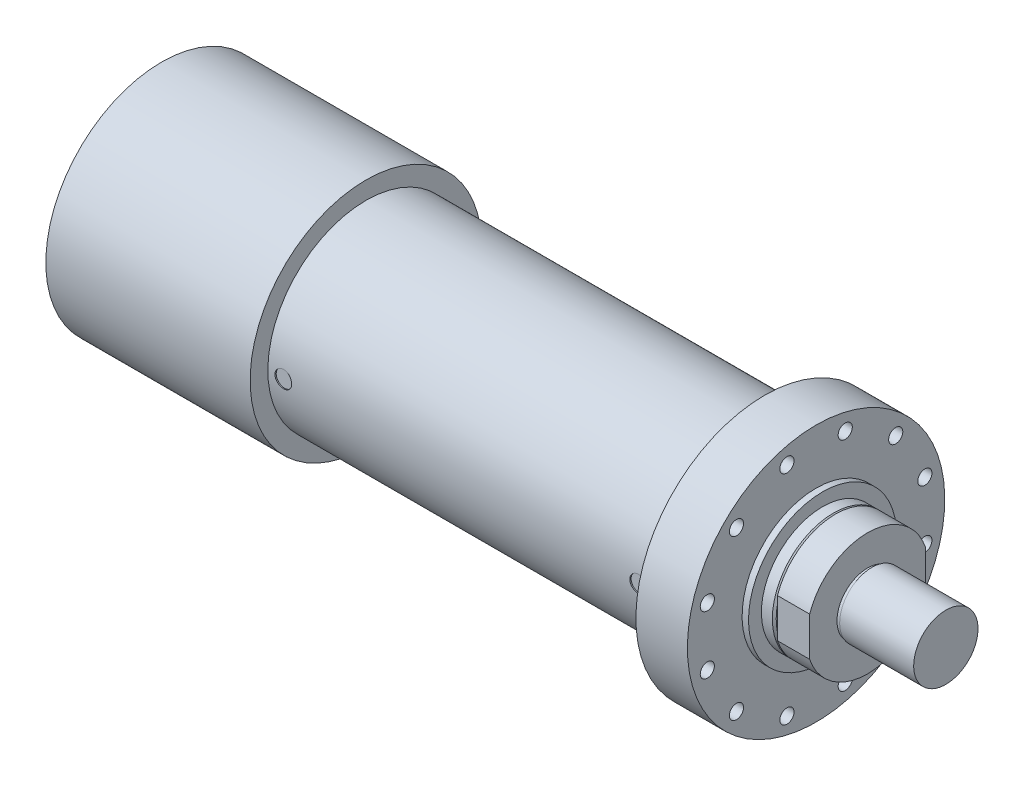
from build123d import *

# Parameters (mm, degrees)
SKETCH_2_W          = 619.5
SKETCH_2_H          = 152.5
SKETCH_3_R          = 200
SKETCH_3_R_2        = 11
EXTRUDE_1_DEPTH     = 80
SKETCH_4_R          = 115
EXTRUDE_2_DEPTH     = 10
SKETCH_5_R          = 95
EXTRUDE_3_DEPTH     = 20
CHAMFER_1_SIZE      = 3
SKETCH_17_R         = 13
CUT_EXTRUDE_6_DEPTH = 2
SKETCH_19_R         = 13
CUT_EXTRUDE_7_DEPTH = 2
SKETCH_23_R         = 180
EXTRUDE_8_DEPTH     = 317.5
EXTRUDE_9_DEPTH     = 50
SKETCH_25_R         = 47.5
EXTRUDE_10_DEPTH    = 5
SKETCH_26_R         = 50
EXTRUDE_11_DEPTH    = 115


with BuildPart() as part:
    # Sketch 2 → Revolve 1 (revolve)
    with BuildSketch(Plane.XY):
        with Locations((309.75, 76.25)):
            Rectangle(SKETCH_2_W, SKETCH_2_H)
    revolve(axis=Axis((619.5, 0, 0), (-1, 0, 0)))

    # Sketch 3 → Extrude 1 (add)
    with BuildSketch(Plane(origin=(619.5, 0, 0), x_dir=(0, 0, -1), z_dir=(1, 0, 0))):
        with Locations(Location((0, 0, 0), (0, 0, 90))):
            Circle(SKETCH_3_R)
        with Locations(Location((169.037019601, 45.293332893, 0), (0, 0, 90))):
            Circle(SKETCH_3_R_2, mode=Mode.SUBTRACT)
        with Locations(Location((169.037019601, -45.293332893, 0), (0, 0, 90))):
            Circle(SKETCH_3_R_2, mode=Mode.SUBTRACT)
        with Locations(Location((123.743686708, -123.743686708, 0), (0, 0, 90))):
            Circle(SKETCH_3_R_2, mode=Mode.SUBTRACT)
        with Locations(Location((45.293332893, -169.037019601, 0), (0, 0, 90))):
            Circle(SKETCH_3_R_2, mode=Mode.SUBTRACT)
        with Locations(Location((-45.293332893, -169.037019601, 0), (0, 0, 90))):
            Circle(SKETCH_3_R_2, mode=Mode.SUBTRACT)
        with Locations(Location((-123.743686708, -123.743686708, 0), (0, 0, 90))):
            Circle(SKETCH_3_R_2, mode=Mode.SUBTRACT)
        with Locations(Location((-169.037019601, -45.293332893, 0), (0, 0, 90))):
            Circle(SKETCH_3_R_2, mode=Mode.SUBTRACT)
        with Locations(Location((-169.037019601, 45.293332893, 0), (0, 0, 90))):
            Circle(SKETCH_3_R_2, mode=Mode.SUBTRACT)
        with Locations(Location((-123.743686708, 123.743686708, 0), (0, 0, 90))):
            Circle(SKETCH_3_R_2, mode=Mode.SUBTRACT)
        with Locations(Location((-45.293332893, 169.037019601, 0), (0, 0, 90))):
            Circle(SKETCH_3_R_2, mode=Mode.SUBTRACT)
        with Locations(Location((45.293332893, 169.037019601, 0), (0, 0, 90))):
            Circle(SKETCH_3_R_2, mode=Mode.SUBTRACT)
        with Locations(Location((123.743686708, 123.743686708, 0), (0, 0, 90))):
            Circle(SKETCH_3_R_2, mode=Mode.SUBTRACT)
    extrude(amount=EXTRUDE_1_DEPTH)

    # Sketch 4 → Extrude 2 (add)
    with BuildSketch(Plane(origin=(699.5, 0, 0), x_dir=(0, 0, -1), z_dir=(1, 0, 0))):
        with Locations(Location((0, 0, 0), (0, 0, 90))):
            Circle(SKETCH_4_R)
    extrude(amount=EXTRUDE_2_DEPTH)

    # Sketch 5 → Extrude 3 (add)
    with BuildSketch(Plane(origin=(709.5, 0, 0), x_dir=(0, 0, -1), z_dir=(1, 0, 0))):
        with Locations(Location((0, 0, 0), (0, 0, 90))):
            Circle(SKETCH_5_R)
    extrude(amount=EXTRUDE_3_DEPTH)

    # Chamfer 1
    chamfer_1_edges = [part.edges().sort_by_distance(p)[0] for p in [
        (729.5, -95, 0),
    ]]
    chamfer(chamfer_1_edges, length=CHAMFER_1_SIZE)

    # Sketch 17 → Cut-Extrude 6 (cut)
    with BuildSketch(Plane.XY.offset(-152.5)):
        with Locations(Location((44, 0, 0), (0, 0, 180))):
            Circle(SKETCH_17_R)
    extrude(amount=CUT_EXTRUDE_6_DEPTH, mode=Mode.SUBTRACT)

    # Sketch 19 → Cut-Extrude 7 (cut)
    with BuildSketch(Plane.XY.offset(152.5)):
        with Locations((24, 0)):
            Circle(SKETCH_19_R)
        with Locations((575.5, 0)):
            Circle(SKETCH_19_R)
    extrude(amount=-CUT_EXTRUDE_7_DEPTH, mode=Mode.SUBTRACT)

    # Sketch 23 → Extrude 8 (add)
    with BuildSketch(Plane.ZY):
        with Locations(Location((0, 0, 0), (0, 0, 90))):
            Circle(SKETCH_23_R)
    extrude(amount=EXTRUDE_8_DEPTH)

    # Sketch 24 → Extrude 9 (add)
    with BuildSketch(Plane(origin=(729.5, 0, 0), x_dir=(0, 0, -1), z_dir=(1, 0, 0))):
        with BuildLine():
            Line((-90, 30.413812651), (-90, -30.413812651))
            ThreePointArc((-90, -30.413812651), (0, -95), (90, -30.413812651))
            Line((90, -30.413812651), (90, 30.413812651))
            ThreePointArc((90, 30.413812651), (0, 95), (-90, 30.413812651))
        make_face()
    extrude(amount=EXTRUDE_9_DEPTH)

    # Sketch 25 → Extrude 10 (add)
    with BuildSketch(Plane(origin=(779.5, 0, 0), x_dir=(0, 0, -1), z_dir=(1, 0, 0))):
        with Locations(Location((0, 0, 0), (0, 0, 90))):
            Circle(SKETCH_25_R)
    extrude(amount=EXTRUDE_10_DEPTH)

    # Sketch 26 → Extrude 11 (add)
    with BuildSketch(Plane(origin=(784.5, 0, 0), x_dir=(0, 0, -1), z_dir=(1, 0, 0))):
        with Locations(Location((1.643994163, 0, 0), (0, 0, 90))):
            Circle(SKETCH_26_R)
    extrude(amount=EXTRUDE_11_DEPTH)


solid = part.part
